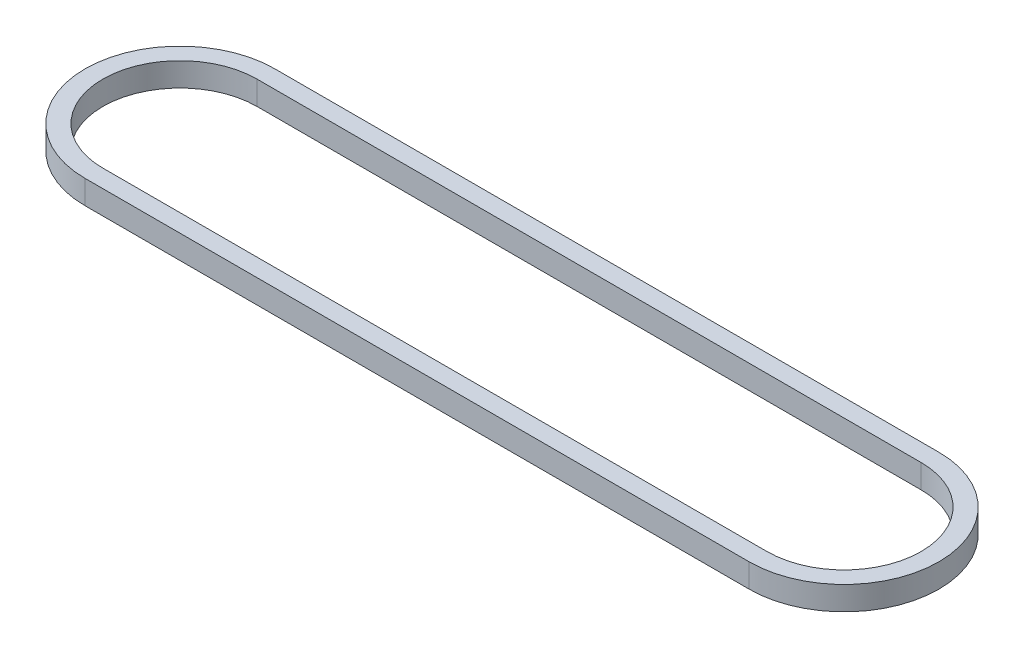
from build123d import *

# Parameters (mm, degrees)
BOSS_EXTRUDE1_DEPTH = 10


with BuildPart() as part:
    # Sketch1 → Boss-Extrude1 (new body)
    with BuildSketch(Plane(origin=(0, 0, 0), x_dir=(1, 0, 0), z_dir=(0, 1, 0))):
        with BuildLine():
            ThreePointArc((280, -40), (320, 0), (280, 40))
            Line((280, 40), (0, 40))
            ThreePointArc((0, 40), (-40, 0), (0, -40))
            Line((0, -40), (280, -40))
        make_face()
        with BuildLine():
            ThreePointArc((0, -32.5), (-32.5, 0), (0, 32.5))
            Line((0, 32.5), (280, 32.5))
            ThreePointArc((280, 32.5), (312.5, 0), (280, -32.5))
            Line((280, -32.5), (0, -32.5))
        make_face(mode=Mode.SUBTRACT)
    extrude(amount=BOSS_EXTRUDE1_DEPTH)


solid = part.part
